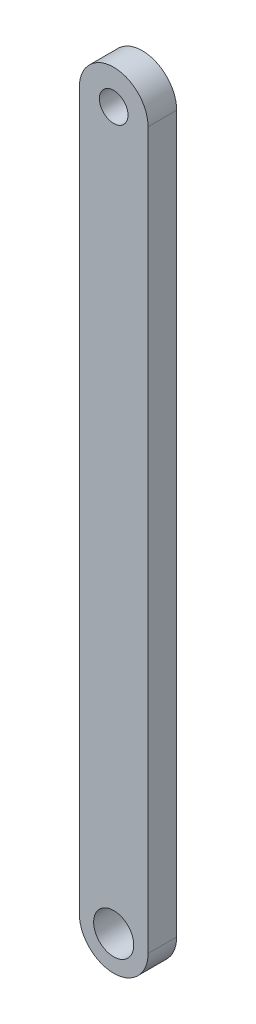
from build123d import *

# Parameters (mm, degrees)
SKETCH1_R      = 5
SKETCH1_R_2    = 7
EXTRUDE1_DEPTH = 10


with BuildPart() as part:
    # Sketch1 → Extrude1 (new body)
    with BuildSketch(Plane.XY):
        with BuildLine():
            Line((-12, 0), (-12, -250))
            ThreePointArc((-12, -250), (0, -262), (12, -250))
            Line((12, -250), (12, 0))
            ThreePointArc((12, 0), (0, 12), (-12, 0))
        make_face()
        Circle(SKETCH1_R, mode=Mode.SUBTRACT)
        with Locations((0, -250)):
            Circle(SKETCH1_R_2, mode=Mode.SUBTRACT)
    extrude(amount=EXTRUDE1_DEPTH)


solid = part.part
